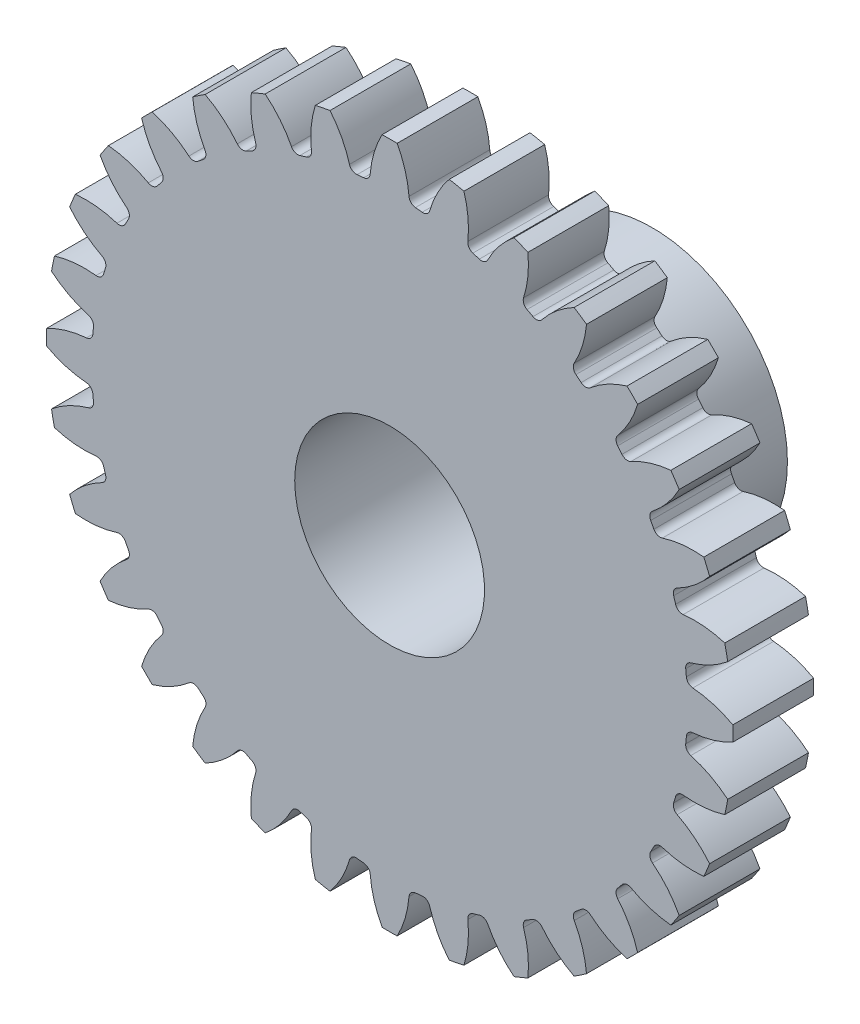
from build123d import *

# Parameters (mm, degrees)
BOSS_EXTRU_1_DEPTH                 = 2
CONG_1_R                           = 0.175
R_P_TITION_CIRCULAIRE4_COUNT       = 32
CONG_1_OF_R_P_TITION_CIRCULAIRE4_R = 0.175
ESQUISSE11_R                       = 3.35
EXTRUSION1_DEPTH                   = 4.5
ESQUISSE10_R                       = 2.35
ENL_V_MAT_EXTRU_4_DEPTH            = 15.89727633


with BuildPart() as part:
    # Esquisse3 → Boss.-Extru.1 (new body)
    with BuildSketch(Plane.XY):
        with BuildLine():
            Line((-2.101583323, 6.779134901), (-1.378706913, -0.560352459))
            Line((-1.378706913, -0.560352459), (-0.655830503, 6.779134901))
            ThreePointArc((-0.655830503, 6.779134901), (-0.773146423, 6.789744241), (-0.890616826, 6.798478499))
            ThreePointArc((-0.890616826, 6.798478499), (-0.974062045, 7.386022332), (-1.192953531, 7.937617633))
            ThreePointArc((-1.192953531, 7.937617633), (-1.378706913, 7.939647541), (-1.564460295, 7.937617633))
            ThreePointArc((-1.564460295, 7.937617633), (-1.783351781, 7.386022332), (-1.866797, 6.798478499))
            ThreePointArc((-1.866797, 6.798478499), (-1.984267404, 6.789744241), (-2.101583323, 6.779134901))
        make_face()
    boss_extru_1 = extrude(amount=BOSS_EXTRU_1_DEPTH)

    # Cong_1
    cong_1_edges = [part.edges().sort_by_distance(p)[0] for p in [
        (-1.866797, 6.798478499, 1),
        (-0.890616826, 6.798478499, 1),
    ]]
    fillet(cong_1_edges, radius=CONG_1_R)

    # R_p_tition circulaire4: Boss.-Extru.1 ×32 about axis
    r_p_tition_circulaire4_axis = Axis((-1.378706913, -0.560352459, 0), (0, 0, 1))
    for i in range(1, R_P_TITION_CIRCULAIRE4_COUNT):
        add(boss_extru_1.rotate(r_p_tition_circulaire4_axis, i * 360 / R_P_TITION_CIRCULAIRE4_COUNT))

    # Cong_1 of R_p_tition circulaire4
    cong_1_of_r_p_tition_circulaire4_edges = [part.edges().sort_by_distance(p)[0] for p in [
        (-3.293055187, 6.561858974, 1),
        (-2.335632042, 6.752302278, 1),
        (-4.645746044, 6.051536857, 1),
        (-3.743873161, 6.425104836, 1),
        (-5.872886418, 5.287123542, 1),
        (-5.061222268, 5.829460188, 1),
        (-6.927317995, 4.297995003, 1),
        (-6.237054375, 4.988258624, 1),
        (-7.76851956, 3.122162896, 1),
        (-7.226182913, 3.933827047, 1),
        (-8.364164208, 1.804813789, 1),
        (-7.990596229, 2.706686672, 1),
        (-8.69136165, 0.39657267, 1),
        (-8.500918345, 1.353995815, 1),
        (-8.737537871, -1.048442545, 1),
        (-8.737537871, -0.072262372, 1),
        (-8.500918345, -2.474700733, 1),
        (-8.69136165, -1.517277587, 1),
        (-7.990596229, -3.827391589, 1),
        (-8.364164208, -2.925518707, 1),
        (-7.226182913, -5.054531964, 1),
        (-7.76851956, -4.242867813, 1),
        (-6.237054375, -6.108963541, 1),
        (-6.927317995, -5.41869992, 1),
        (-5.061222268, -6.950165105, 1),
        (-5.872886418, -6.407828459, 1),
        (-3.743873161, -7.545809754, 1),
        (-4.645746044, -7.172241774, 1),
        (-2.335632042, -7.873007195, 1),
        (-3.293055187, -7.682563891, 1),
        (-0.890616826, -7.919183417, 1),
        (-1.866797, -7.919183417, 1),
        (0.535641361, -7.682563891, 1),
        (-0.421781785, -7.873007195, 1),
        (1.888332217, -7.172241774, 1),
        (0.986459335, -7.545809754, 1),
        (3.115472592, -6.407828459, 1),
        (2.303808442, -6.950165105, 1),
        (4.169904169, -5.41869992, 1),
        (3.479640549, -6.108963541, 1),
        (5.011105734, -4.242867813, 1),
        (4.468769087, -5.054531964, 1),
        (5.606750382, -2.925518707, 1),
        (5.233182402, -3.827391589, 1),
        (5.933947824, -1.517277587, 1),
        (5.743504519, -2.474700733, 1),
        (5.980124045, -0.072262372, 1),
        (5.980124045, -1.048442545, 1),
        (5.743504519, 1.353995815, 1),
        (5.933947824, 0.39657267, 1),
        (5.233182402, 2.706686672, 1),
        (5.606750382, 1.804813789, 1),
        (4.468769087, 3.933827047, 1),
        (5.011105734, 3.122162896, 1),
        (3.479640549, 4.988258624, 1),
        (4.169904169, 4.297995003, 1),
        (2.303808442, 5.829460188, 1),
        (3.115472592, 5.287123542, 1),
        (0.986459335, 6.425104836, 1),
        (1.888332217, 6.051536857, 1),
        (-0.421781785, 6.752302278, 1),
        (0.535641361, 6.561858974, 1),
    ]]
    fillet(cong_1_of_r_p_tition_circulaire4_edges, radius=CONG_1_OF_R_P_TITION_CIRCULAIRE4_R)

    # Esquisse11 → Extrusion1 (add)
    with BuildSketch(Plane(origin=(0, 0, 0), x_dir=(-1, 0, 0), z_dir=(0, 0, -1))):
        with Locations(Location((1.378706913, -0.560352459, 0), (0, 0, 180))):
            Circle(ESQUISSE11_R)
    extrude(amount=EXTRUSION1_DEPTH)

    # Esquisse10 → Enl_v. mat.-Extru.4 (cut, through all)
    with BuildSketch(Plane.XY.offset(-4.5)):
        with Locations(Location((-1.378706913, -0.560352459, 0), (0, 0, 180))):
            Circle(ESQUISSE10_R)
    extrude(amount=ENL_V_MAT_EXTRU_4_DEPTH, mode=Mode.SUBTRACT)


solid = part.part
